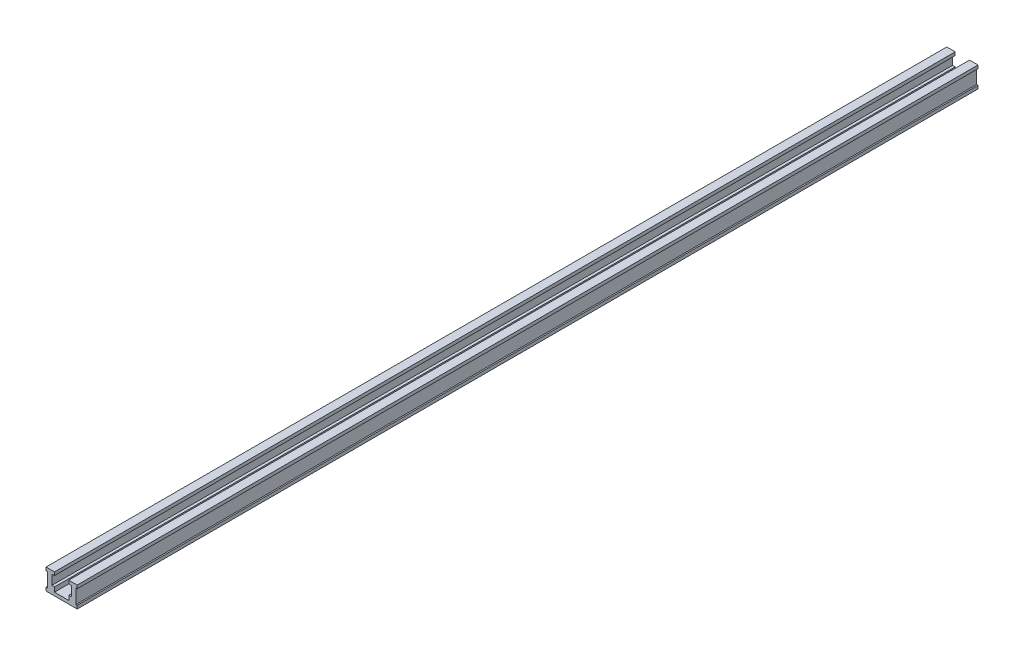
from build123d import *

# Parameters (mm, degrees)
ESTRUSIONE_ESTRUSIONE1_DEPTH = 550


with BuildPart() as part:
    # Schizzo1 → Estrusione-Estrusione1 (new body)
    with BuildSketch(Plane.XY):
        Polygon((3.703243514, -9.451076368), (3.703243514, -11.435451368), (-15.346756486, -11.435451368), (-15.346756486, -9.451076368), (-14.553006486, -9.451076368), (-14.553006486, -0.719826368), (-15.346756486, -0.719826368), (-15.346756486, 1.264548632), (-10.187381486, 1.264548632), (-10.187381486, -0.719826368), (-11.774881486, -0.719826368), (-11.774881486, -6.672951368), (-10.187381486, -6.672951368), (-10.187381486, -9.451076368), (-1.456131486, -9.451076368), (-1.456131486, -6.672951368), (0.131368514, -6.672951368), (0.131368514, -0.719826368), (-1.456131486, -0.719826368), (-1.456131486, 1.264548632), (3.703243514, 1.264548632), (3.703243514, -0.719826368), (2.909493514, -0.719826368), (2.909493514, -9.451076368), align=None)
    extrude(amount=ESTRUSIONE_ESTRUSIONE1_DEPTH)


solid = part.part
